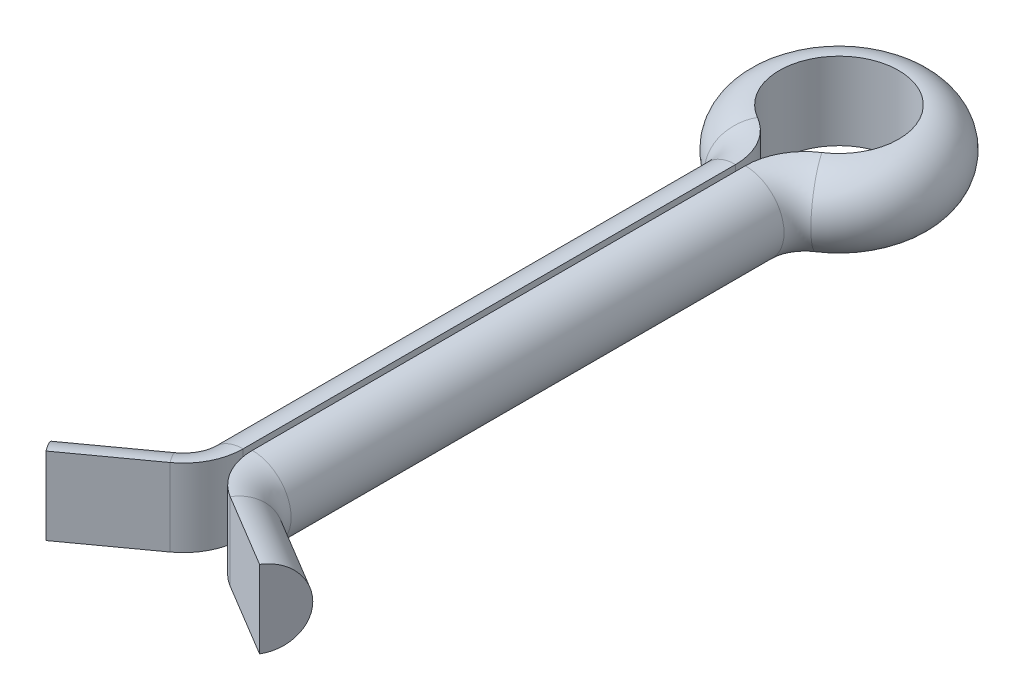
ISO-10303-21;
HEADER;
FILE_DESCRIPTION(('STEP AP214'),'2;1');
FILE_NAME('part.step','',(''),(''),'','','');
FILE_SCHEMA(('AUTOMOTIVE_DESIGN { 1 0 10303 214 1 1 1 1 }'));
ENDSEC;
DATA;
#1=APPLICATION_CONTEXT('core data for automotive mechanical design processes');
#2=APPLICATION_PROTOCOL_DEFINITION('international standard','automotive_design',2000,#1);
#3=PRODUCT_CONTEXT('',#1,'mechanical');
#4=PRODUCT('Part','Part','',(#3));
#5=PRODUCT_RELATED_PRODUCT_CATEGORY('part','',(#4));
#6=PRODUCT_DEFINITION_FORMATION('','',#4);
#7=PRODUCT_DEFINITION_CONTEXT('part definition',#1,'design');
#8=PRODUCT_DEFINITION('design','',#6,#7);
#9=PRODUCT_DEFINITION_SHAPE('','',#8);
#10=(LENGTH_UNIT() NAMED_UNIT(*) SI_UNIT(.MILLI.,.METRE.));
#11=(NAMED_UNIT(*) PLANE_ANGLE_UNIT() SI_UNIT($,.RADIAN.));
#12=(NAMED_UNIT(*) SI_UNIT($,.STERADIAN.) SOLID_ANGLE_UNIT());
#13=UNCERTAINTY_MEASURE_WITH_UNIT(LENGTH_MEASURE(1.E-05),#10,'distance_accuracy_value','');
#14=(GEOMETRIC_REPRESENTATION_CONTEXT(3) GLOBAL_UNCERTAINTY_ASSIGNED_CONTEXT((#13)) GLOBAL_UNIT_ASSIGNED_CONTEXT((#10,
#11,#12)) REPRESENTATION_CONTEXT('',''));
#15=CARTESIAN_POINT('',(0.,0.,0.));
#16=DIRECTION('',(0.,0.,1.));
#17=DIRECTION('',(1.,0.,0.));
#18=AXIS2_PLACEMENT_3D('',#15,#16,#17);
#19=CARTESIAN_POINT('',(-0.827997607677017,1.29999999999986,0.598792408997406));
#20=DIRECTION('',(-0.586001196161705,0.,-0.810310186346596));
#21=DIRECTION('',(-0.810310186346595,0.,0.586001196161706));
#22=AXIS2_PLACEMENT_3D('',#19,#20,#21);
#23=PLANE('',#22);
#24=DIRECTION('',(0.,-1.,0.));
#25=VECTOR('',#24,1.);
#26=CARTESIAN_POINT('',(-0.827997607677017,1.29999999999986,0.598792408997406));
#27=LINE('',#26,#25);
#28=CARTESIAN_POINT('',(-0.827997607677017,1.29999999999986,0.598792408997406));
#29=VERTEX_POINT('',#28);
#30=CARTESIAN_POINT('',(-0.827997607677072,-1.3000000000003,0.598792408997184));
#31=VERTEX_POINT('',#30);
#32=EDGE_CURVE('E207',#29,#31,#27,.T.);
#33=ORIENTED_EDGE('',*,*,#32,.F.);
#34=DIRECTION('',(-0.810310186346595,0.,0.586001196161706));
#35=VECTOR('',#34,1.);
#36=CARTESIAN_POINT('',(-0.827997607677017,1.29999999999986,0.598792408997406));
#37=LINE('',#36,#35);
#38=CARTESIAN_POINT('',(-3.2412407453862,1.29999999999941,2.34400478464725));
#39=VERTEX_POINT('',#38);
#40=EDGE_CURVE('E39',#29,#39,#37,.T.);
#41=ORIENTED_EDGE('',*,*,#40,.T.);
#42=DIRECTION('',(0.,-1.,0.));
#43=VECTOR('',#42,1.);
#44=CARTESIAN_POINT('',(-3.2412407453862,1.29999999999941,2.34400478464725));
#45=LINE('',#44,#43);
#46=CARTESIAN_POINT('',(-3.24124074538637,-1.30000000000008,2.34400478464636));
#47=VERTEX_POINT('',#46);
#48=EDGE_CURVE('E46',#39,#47,#45,.T.);
#49=ORIENTED_EDGE('',*,*,#48,.T.);
#50=DIRECTION('',(-0.810310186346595,0.,0.586001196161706));
#51=VECTOR('',#50,1.);
#52=CARTESIAN_POINT('',(-0.827997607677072,-1.3000000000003,0.598792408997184));
#53=LINE('',#52,#51);
#54=EDGE_CURVE('E11',#31,#47,#53,.T.);
#55=ORIENTED_EDGE('',*,*,#54,.F.);
#56=EDGE_LOOP('',(#33,#41,#49,#55));
#57=FACE_BOUND('',#56,.T.);
#58=ADVANCED_FACE('F32',(#57),#23,.F.);
#59=CARTESIAN_POINT('',(-0.827997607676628,-4.44089209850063E-13,0.598792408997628));
#60=DIRECTION('',(-0.810310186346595,0.,0.586001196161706));
#61=DIRECTION('',(0.586001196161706,0.,0.810310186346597));
#62=AXIS2_PLACEMENT_3D('',#59,#60,#61);
#63=CYLINDRICAL_SURFACE('',#62,1.3);
#64=CARTESIAN_POINT('',(-0.827997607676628,-4.44089209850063E-13,0.598792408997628));
#65=DIRECTION('',(0.810310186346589,0.,-0.586001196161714));
#66=DIRECTION('',(-0.586001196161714,0.,-0.81031018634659));
#67=AXIS2_PLACEMENT_3D('',#64,#65,#66);
#68=CIRCLE('',#67,1.3);
#69=EDGE_CURVE('E204',#31,#29,#68,.T.);
#70=ORIENTED_EDGE('',*,*,#69,.F.);
#71=ORIENTED_EDGE('',*,*,#54,.T.);
#72=CARTESIAN_POINT('',(-3.24124074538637,0.,2.34400478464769));
#73=DIRECTION('',(0.810310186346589,0.,-0.586001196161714));
#74=DIRECTION('',(-0.586001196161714,0.,-0.81031018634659));
#75=AXIS2_PLACEMENT_3D('',#72,#73,#74);
#76=CIRCLE('',#75,1.3);
#77=EDGE_CURVE('E52',#47,#39,#76,.T.);
#78=ORIENTED_EDGE('',*,*,#77,.T.);
#79=ORIENTED_EDGE('',*,*,#40,.F.);
#80=EDGE_LOOP('',(#70,#71,#78,#79));
#81=FACE_BOUND('',#80,.T.);
#82=ADVANCED_FACE('F219',(#81),#63,.T.);
#83=CARTESIAN_POINT('',(-1.99999999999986,-2.22044604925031E-13,-1.02182796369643));
#84=DIRECTION('',(0.,-1.,0.));
#85=DIRECTION('',(0.,0.,-1.));
#86=AXIS2_PLACEMENT_3D('',#83,#84,#85);
#87=CYLINDRICAL_SURFACE('',#86,1.99999999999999);
#88=DIRECTION('',(0.,-1.,0.));
#89=VECTOR('',#88,1.);
#90=CARTESIAN_POINT('',(0.,1.29999999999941,-1.02182796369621));
#91=LINE('',#90,#89);
#92=CARTESIAN_POINT('',(0.,1.29999999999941,-1.02182796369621));
#93=VERTEX_POINT('',#92);
#94=CARTESIAN_POINT('',(-5.27355936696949E-13,-1.29999999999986,-1.02182796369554));
#95=VERTEX_POINT('',#94);
#96=EDGE_CURVE('E195',#93,#95,#91,.T.);
#97=ORIENTED_EDGE('',*,*,#96,.F.);
#98=CARTESIAN_POINT('',(-2.00000000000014,1.30000000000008,-1.02182796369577));
#99=DIRECTION('',(0.,-1.,0.));
#100=DIRECTION('',(0.,0.,-1.));
#101=AXIS2_PLACEMENT_3D('',#98,#99,#100);
#102=CIRCLE('',#101,1.99999999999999);
#103=EDGE_CURVE('E210',#93,#29,#102,.T.);
#104=ORIENTED_EDGE('',*,*,#103,.T.);
#105=ORIENTED_EDGE('',*,*,#32,.T.);
#106=CARTESIAN_POINT('',(-1.99999999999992,-1.3000000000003,-1.02182796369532));
#107=DIRECTION('',(0.,-1.,0.));
#108=DIRECTION('',(0.,0.,-1.));
#109=AXIS2_PLACEMENT_3D('',#106,#107,#108);
#110=CIRCLE('',#109,1.99999999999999);
#111=EDGE_CURVE('E213',#95,#31,#110,.T.);
#112=ORIENTED_EDGE('',*,*,#111,.F.);
#113=EDGE_LOOP('',(#97,#104,#105,#112));
#114=FACE_BOUND('',#113,.T.);
#115=ADVANCED_FACE('F223',(#114),#87,.T.);
#116=CARTESIAN_POINT('',(-1.99999999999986,-2.22044604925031E-13,-1.02182796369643));
#117=DIRECTION('',(0.,-1.,0.));
#118=DIRECTION('',(0.,0.,-1.));
#119=AXIS2_PLACEMENT_3D('',#116,#117,#118);
#120=TOROIDAL_SURFACE('',#119,1.99999999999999,1.3);
#121=CARTESIAN_POINT('',(0.,-4.44089209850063E-13,-1.02182796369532));
#122=DIRECTION('',(0.,0.,-1.));
#123=DIRECTION('',(-1.,0.,0.));
#124=AXIS2_PLACEMENT_3D('',#121,#122,#123);
#125=CIRCLE('',#124,1.3);
#126=EDGE_CURVE('E192',#95,#93,#125,.T.);
#127=ORIENTED_EDGE('',*,*,#126,.F.);
#128=ORIENTED_EDGE('',*,*,#111,.T.);
#129=ORIENTED_EDGE('',*,*,#69,.T.);
#130=ORIENTED_EDGE('',*,*,#103,.F.);
#131=EDGE_LOOP('',(#127,#128,#129,#130));
#132=FACE_BOUND('',#131,.T.);
#133=ADVANCED_FACE('F225',(#132),#120,.T.);
#134=CARTESIAN_POINT('',(0.,1.29999999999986,-17.5358983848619));
#135=DIRECTION('',(-1.,0.,0.));
#136=DIRECTION('',(0.,0.,1.));
#137=AXIS2_PLACEMENT_3D('',#134,#135,#136);
#138=PLANE('',#137);
#139=DIRECTION('',(0.,-1.,0.));
#140=VECTOR('',#139,1.);
#141=CARTESIAN_POINT('',(0.,1.29999999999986,-17.5358983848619));
#142=LINE('',#141,#140);
#143=CARTESIAN_POINT('',(0.,1.29999999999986,-17.5358983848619));
#144=VERTEX_POINT('',#143);
#145=CARTESIAN_POINT('',(-1.38777878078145E-13,-1.3000000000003,-17.5358983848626));
#146=VERTEX_POINT('',#145);
#147=EDGE_CURVE('E183',#144,#146,#142,.T.);
#148=ORIENTED_EDGE('',*,*,#147,.F.);
#149=DIRECTION('',(0.,0.,1.));
#150=VECTOR('',#149,1.);
#151=CARTESIAN_POINT('',(0.,1.29999999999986,-17.5358983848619));
#152=LINE('',#151,#150);
#153=EDGE_CURVE('E198',#144,#93,#152,.T.);
#154=ORIENTED_EDGE('',*,*,#153,.T.);
#155=ORIENTED_EDGE('',*,*,#96,.T.);
#156=DIRECTION('',(0.,0.,1.));
#157=VECTOR('',#156,1.);
#158=CARTESIAN_POINT('',(-1.38777878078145E-13,-1.3000000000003,-17.5358983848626));
#159=LINE('',#158,#157);
#160=EDGE_CURVE('E201',#146,#95,#159,.T.);
#161=ORIENTED_EDGE('',*,*,#160,.F.);
#162=EDGE_LOOP('',(#148,#154,#155,#161));
#163=FACE_BOUND('',#162,.T.);
#164=ADVANCED_FACE('F229',(#163),#138,.F.);
#165=CARTESIAN_POINT('',(0.,-2.22044604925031E-13,-17.5358983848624));
#166=DIRECTION('',(0.,0.,1.));
#167=DIRECTION('',(1.,0.,0.));
#168=AXIS2_PLACEMENT_3D('',#165,#166,#167);
#169=CYLINDRICAL_SURFACE('',#168,1.3);
#170=CARTESIAN_POINT('',(0.,-2.22044604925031E-13,-17.5358983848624));
#171=DIRECTION('',(0.,0.,-1.));
#172=DIRECTION('',(-1.,0.,0.));
#173=AXIS2_PLACEMENT_3D('',#170,#171,#172);
#174=CIRCLE('',#173,1.3);
#175=EDGE_CURVE('E180',#146,#144,#174,.T.);
#176=ORIENTED_EDGE('',*,*,#175,.F.);
#177=ORIENTED_EDGE('',*,*,#160,.T.);
#178=ORIENTED_EDGE('',*,*,#126,.T.);
#179=ORIENTED_EDGE('',*,*,#153,.F.);
#180=EDGE_LOOP('',(#176,#177,#178,#179));
#181=FACE_BOUND('',#180,.T.);
#182=ADVANCED_FACE('F231',(#181),#169,.T.);
#183=CARTESIAN_POINT('',(-1.99999999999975,4.44089209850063E-13,-17.5358983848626));
#184=DIRECTION('',(0.,-1.,0.));
#185=DIRECTION('',(0.,0.,-1.));
#186=AXIS2_PLACEMENT_3D('',#183,#184,#185);
#187=CYLINDRICAL_SURFACE('',#186,1.99999999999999);
#188=DIRECTION('',(0.,-1.,0.));
#189=VECTOR('',#188,1.);
#190=CARTESIAN_POINT('',(-0.999999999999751,1.29999999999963,-19.2679491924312));
#191=LINE('',#190,#189);
#192=CARTESIAN_POINT('',(-0.999999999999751,1.29999999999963,-19.2679491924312));
#193=VERTEX_POINT('',#192);
#194=CARTESIAN_POINT('',(-1.00000000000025,-1.29999999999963,-19.2679491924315));
#195=VERTEX_POINT('',#194);
#196=EDGE_CURVE('E171',#193,#195,#191,.T.);
#197=ORIENTED_EDGE('',*,*,#196,.F.);
#198=CARTESIAN_POINT('',(-1.99999999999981,1.29999999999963,-17.5358983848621));
#199=DIRECTION('',(0.,-1.,0.));
#200=DIRECTION('',(0.,0.,-1.));
#201=AXIS2_PLACEMENT_3D('',#198,#199,#200);
#202=CIRCLE('',#201,1.99999999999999);
#203=EDGE_CURVE('E186',#193,#144,#202,.T.);
#204=ORIENTED_EDGE('',*,*,#203,.T.);
#205=ORIENTED_EDGE('',*,*,#147,.T.);
#206=CARTESIAN_POINT('',(-1.99999999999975,-1.29999999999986,-17.5358983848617));
#207=DIRECTION('',(0.,-1.,0.));
#208=DIRECTION('',(0.,0.,-1.));
#209=AXIS2_PLACEMENT_3D('',#206,#207,#208);
#210=CIRCLE('',#209,1.99999999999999);
#211=EDGE_CURVE('E189',#195,#146,#210,.T.);
#212=ORIENTED_EDGE('',*,*,#211,.F.);
#213=EDGE_LOOP('',(#197,#204,#205,#212));
#214=FACE_BOUND('',#213,.T.);
#215=ADVANCED_FACE('F235',(#214),#187,.T.);
#216=CARTESIAN_POINT('',(-1.99999999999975,4.44089209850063E-13,-17.5358983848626));
#217=DIRECTION('',(0.,-1.,0.));
#218=DIRECTION('',(0.,0.,-1.));
#219=AXIS2_PLACEMENT_3D('',#216,#217,#218);
#220=TOROIDAL_SURFACE('',#219,1.99999999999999,1.3);
#221=CARTESIAN_POINT('',(-0.999999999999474,-2.22044604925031E-13,-19.2679491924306));
#222=DIRECTION('',(-0.866025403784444,0.,-0.499999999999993));
#223=DIRECTION('',(-0.499999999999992,0.,0.866025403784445));
#224=AXIS2_PLACEMENT_3D('',#221,#222,#223);
#225=CIRCLE('',#224,1.3);
#226=EDGE_CURVE('E168',#195,#193,#225,.T.);
#227=ORIENTED_EDGE('',*,*,#226,.F.);
#228=ORIENTED_EDGE('',*,*,#211,.T.);
#229=ORIENTED_EDGE('',*,*,#175,.T.);
#230=ORIENTED_EDGE('',*,*,#203,.F.);
#231=EDGE_LOOP('',(#227,#228,#229,#230));
#232=FACE_BOUND('',#231,.T.);
#233=ADVANCED_FACE('F237',(#232),#220,.T.);
#234=CARTESIAN_POINT('',(-1.94289029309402E-13,0.,-20.9999999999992));
#235=DIRECTION('',(0.,1.,0.));
#236=DIRECTION('',(0.,0.,1.));
#237=AXIS2_PLACEMENT_3D('',#234,#235,#236);
#238=CYLINDRICAL_SURFACE('',#237,2.00000000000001);
#239=DIRECTION('',(0.,-1.,0.));
#240=VECTOR('',#239,1.);
#241=CARTESIAN_POINT('',(1.10000000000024,1.29999999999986,-19.3296706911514));
#242=LINE('',#241,#240);
#243=CARTESIAN_POINT('',(1.10000000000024,1.29999999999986,-19.3296706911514));
#244=VERTEX_POINT('',#243);
#245=CARTESIAN_POINT('',(1.0999999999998,-1.29999999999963,-19.329670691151));
#246=VERTEX_POINT('',#245);
#247=EDGE_CURVE('E159',#244,#246,#242,.T.);
#248=ORIENTED_EDGE('',*,*,#247,.F.);
#249=CARTESIAN_POINT('',(-5.82867087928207E-13,1.29999999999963,-21.0000000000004));
#250=DIRECTION('',(0.,1.,0.));
#251=DIRECTION('',(0.,0.,1.));
#252=AXIS2_PLACEMENT_3D('',#249,#250,#251);
#253=CIRCLE('',#252,2.00000000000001);
#254=EDGE_CURVE('E174',#244,#193,#253,.T.);
#255=ORIENTED_EDGE('',*,*,#254,.T.);
#256=ORIENTED_EDGE('',*,*,#196,.T.);
#257=CARTESIAN_POINT('',(-4.16333634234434E-13,-1.3000000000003,-20.9999999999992));
#258=DIRECTION('',(0.,1.,0.));
#259=DIRECTION('',(0.,0.,1.));
#260=AXIS2_PLACEMENT_3D('',#257,#258,#259);
#261=CIRCLE('',#260,2.00000000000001);
#262=EDGE_CURVE('E177',#246,#195,#261,.T.);
#263=ORIENTED_EDGE('',*,*,#262,.F.);
#264=EDGE_LOOP('',(#248,#255,#256,#263));
#265=FACE_BOUND('',#264,.T.);
#266=ADVANCED_FACE('F241',(#265),#238,.F.);
#267=CARTESIAN_POINT('',(-1.94289029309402E-13,0.,-20.9999999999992));
#268=DIRECTION('',(0.,1.,0.));
#269=DIRECTION('',(0.,0.,1.));
#270=AXIS2_PLACEMENT_3D('',#267,#268,#269);
#271=TOROIDAL_SURFACE('',#270,2.00000000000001,1.3);
#272=CARTESIAN_POINT('',(1.09999999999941,-2.22044604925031E-13,-19.3296706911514));
#273=DIRECTION('',(-0.835164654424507,0.,0.549999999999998));
#274=DIRECTION('',(0.549999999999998,0.,0.835164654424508));
#275=AXIS2_PLACEMENT_3D('',#272,#273,#274);
#276=CIRCLE('',#275,1.3);
#277=EDGE_CURVE('E156',#246,#244,#276,.T.);
#278=ORIENTED_EDGE('',*,*,#277,.F.);
#279=ORIENTED_EDGE('',*,*,#262,.T.);
#280=ORIENTED_EDGE('',*,*,#226,.T.);
#281=ORIENTED_EDGE('',*,*,#254,.F.);
#282=EDGE_LOOP('',(#278,#279,#280,#281));
#283=FACE_BOUND('',#282,.T.);
#284=ADVANCED_FACE('F243',(#283),#271,.T.);
#285=CARTESIAN_POINT('',(2.20000000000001,-4.44089209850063E-13,-17.6593413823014));
#286=DIRECTION('',(0.,-1.,0.));
#287=DIRECTION('',(0.,0.,-1.));
#288=AXIS2_PLACEMENT_3D('',#285,#286,#287);
#289=CYLINDRICAL_SURFACE('',#288,2.);
#290=DIRECTION('',(0.,-1.,0.));
#291=VECTOR('',#290,1.);
#292=CARTESIAN_POINT('',(0.200000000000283,1.29999999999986,-17.6593413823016));
#293=LINE('',#292,#291);
#294=CARTESIAN_POINT('',(0.200000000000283,1.29999999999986,-17.6593413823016));
#295=VERTEX_POINT('',#294);
#296=CARTESIAN_POINT('',(0.199999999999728,-1.30000000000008,-17.6593413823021));
#297=VERTEX_POINT('',#296);
#298=EDGE_CURVE('E147',#295,#297,#293,.T.);
#299=ORIENTED_EDGE('',*,*,#298,.F.);
#300=CARTESIAN_POINT('',(2.20000000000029,1.30000000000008,-17.6593413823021));
#301=DIRECTION('',(0.,-1.,0.));
#302=DIRECTION('',(0.,0.,-1.));
#303=AXIS2_PLACEMENT_3D('',#300,#301,#302);
#304=CIRCLE('',#303,2.);
#305=EDGE_CURVE('E162',#295,#244,#304,.T.);
#306=ORIENTED_EDGE('',*,*,#305,.T.);
#307=ORIENTED_EDGE('',*,*,#247,.T.);
#308=CARTESIAN_POINT('',(2.19999999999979,-1.30000000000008,-17.6593413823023));
#309=DIRECTION('',(0.,-1.,0.));
#310=DIRECTION('',(0.,0.,-1.));
#311=AXIS2_PLACEMENT_3D('',#308,#309,#310);
#312=CIRCLE('',#311,2.);
#313=EDGE_CURVE('E165',#297,#246,#312,.T.);
#314=ORIENTED_EDGE('',*,*,#313,.F.);
#315=EDGE_LOOP('',(#299,#306,#307,#314));
#316=FACE_BOUND('',#315,.T.);
#317=ADVANCED_FACE('F247',(#316),#289,.T.);
#318=CARTESIAN_POINT('',(2.20000000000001,-4.44089209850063E-13,-17.6593413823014));
#319=DIRECTION('',(0.,-1.,0.));
#320=DIRECTION('',(0.,0.,-1.));
#321=AXIS2_PLACEMENT_3D('',#318,#319,#320);
#322=TOROIDAL_SURFACE('',#321,2.,1.3);
#323=CARTESIAN_POINT('',(0.199999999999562,-4.44089209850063E-13,-17.6593413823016));
#324=DIRECTION('',(0.,0.,1.));
#325=DIRECTION('',(1.,0.,0.));
#326=AXIS2_PLACEMENT_3D('',#323,#324,#325);
#327=CIRCLE('',#326,1.3);
#328=EDGE_CURVE('E144',#297,#295,#327,.T.);
#329=ORIENTED_EDGE('',*,*,#328,.F.);
#330=ORIENTED_EDGE('',*,*,#313,.T.);
#331=ORIENTED_EDGE('',*,*,#277,.T.);
#332=ORIENTED_EDGE('',*,*,#305,.F.);
#333=EDGE_LOOP('',(#329,#330,#331,#332));
#334=FACE_BOUND('',#333,.T.);
#335=ADVANCED_FACE('F249',(#334),#322,.T.);
#336=CARTESIAN_POINT('',(0.199999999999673,1.29999999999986,-1.13324821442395));
#337=DIRECTION('',(1.,0.,0.));
#338=DIRECTION('',(0.,0.,-1.));
#339=AXIS2_PLACEMENT_3D('',#336,#337,#338);
#340=PLANE('',#339);
#341=DIRECTION('',(0.,-1.,0.));
#342=VECTOR('',#341,1.);
#343=CARTESIAN_POINT('',(0.199999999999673,1.29999999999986,-1.13324821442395));
#344=LINE('',#343,#342);
#345=CARTESIAN_POINT('',(0.199999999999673,1.29999999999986,-1.13324821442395));
#346=VERTEX_POINT('',#345);
#347=CARTESIAN_POINT('',(0.199999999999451,-1.29999999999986,-1.13324821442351));
#348=VERTEX_POINT('',#347);
#349=EDGE_CURVE('E135',#346,#348,#344,.T.);
#350=ORIENTED_EDGE('',*,*,#349,.F.);
#351=DIRECTION('',(0.,0.,-1.));
#352=VECTOR('',#351,1.);
#353=CARTESIAN_POINT('',(0.199999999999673,1.29999999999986,-1.13324821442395));
#354=LINE('',#353,#352);
#355=EDGE_CURVE('E150',#346,#295,#354,.T.);
#356=ORIENTED_EDGE('',*,*,#355,.T.);
#357=ORIENTED_EDGE('',*,*,#298,.T.);
#358=DIRECTION('',(0.,0.,-1.));
#359=VECTOR('',#358,1.);
#360=CARTESIAN_POINT('',(0.199999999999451,-1.29999999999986,-1.13324821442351));
#361=LINE('',#360,#359);
#362=EDGE_CURVE('E153',#348,#297,#361,.T.);
#363=ORIENTED_EDGE('',*,*,#362,.F.);
#364=EDGE_LOOP('',(#350,#356,#357,#363));
#365=FACE_BOUND('',#364,.T.);
#366=ADVANCED_FACE('F253',(#365),#340,.F.);
#367=CARTESIAN_POINT('',(0.200000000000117,-2.22044604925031E-13,-1.13324821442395));
#368=DIRECTION('',(0.,0.,-1.));
#369=DIRECTION('',(-1.,0.,0.));
#370=AXIS2_PLACEMENT_3D('',#367,#368,#369);
#371=CYLINDRICAL_SURFACE('',#370,1.3);
#372=CARTESIAN_POINT('',(0.200000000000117,-2.22044604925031E-13,-1.13324821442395));
#373=DIRECTION('',(0.,0.,1.));
#374=DIRECTION('',(1.,0.,0.));
#375=AXIS2_PLACEMENT_3D('',#372,#373,#374);
#376=CIRCLE('',#375,1.3);
#377=EDGE_CURVE('E131',#348,#346,#376,.T.);
#378=ORIENTED_EDGE('',*,*,#377,.F.);
#379=ORIENTED_EDGE('',*,*,#362,.T.);
#380=ORIENTED_EDGE('',*,*,#328,.T.);
#381=ORIENTED_EDGE('',*,*,#355,.F.);
#382=EDGE_LOOP('',(#378,#379,#380,#381));
#383=FACE_BOUND('',#382,.T.);
#384=ADVANCED_FACE('F255',(#383),#371,.T.);
#385=CARTESIAN_POINT('',(2.20000000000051,-2.22044604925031E-13,-1.13324821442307));
#386=DIRECTION('',(0.,-1.,0.));
#387=DIRECTION('',(0.,0.,-1.));
#388=AXIS2_PLACEMENT_3D('',#385,#386,#387);
#389=CYLINDRICAL_SURFACE('',#388,2.);
#390=DIRECTION('',(0.,-1.,0.));
#391=VECTOR('',#390,1.);
#392=CARTESIAN_POINT('',(1.17213504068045,1.29999999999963,0.582413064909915));
#393=LINE('',#392,#391);
#394=CARTESIAN_POINT('',(1.17213504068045,1.29999999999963,0.582413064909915));
#395=VERTEX_POINT('',#394);
#396=CARTESIAN_POINT('',(1.17213504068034,-1.29999999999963,0.582413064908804));
#397=VERTEX_POINT('',#396);
#398=EDGE_CURVE('E120',#395,#397,#393,.T.);
#399=ORIENTED_EDGE('',*,*,#398,.F.);
#400=CARTESIAN_POINT('',(2.19999999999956,1.3000000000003,-1.13324821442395));
#401=DIRECTION('',(0.,-1.,0.));
#402=DIRECTION('',(0.,0.,-1.));
#403=AXIS2_PLACEMENT_3D('',#400,#401,#402);
#404=CIRCLE('',#403,2.);
#405=EDGE_CURVE('E138',#395,#346,#404,.T.);
#406=ORIENTED_EDGE('',*,*,#405,.T.);
#407=ORIENTED_EDGE('',*,*,#349,.T.);
#408=CARTESIAN_POINT('',(2.19999999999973,-1.30000000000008,-1.1332482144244));
#409=DIRECTION('',(0.,-1.,0.));
#410=DIRECTION('',(0.,0.,-1.));
#411=AXIS2_PLACEMENT_3D('',#408,#409,#410);
#412=CIRCLE('',#411,2.);
#413=EDGE_CURVE('E141',#397,#348,#412,.T.);
#414=ORIENTED_EDGE('',*,*,#413,.F.);
#415=EDGE_LOOP('',(#399,#406,#407,#414));
#416=FACE_BOUND('',#415,.T.);
#417=ADVANCED_FACE('F259',(#416),#389,.T.);
#418=CARTESIAN_POINT('',(2.20000000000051,-2.22044604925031E-13,-1.13324821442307));
#419=DIRECTION('',(0.,-1.,0.));
#420=DIRECTION('',(0.,0.,-1.));
#421=AXIS2_PLACEMENT_3D('',#418,#419,#420);
#422=TOROIDAL_SURFACE('',#421,2.,1.3);
#423=CARTESIAN_POINT('',(1.17213504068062,-2.22044604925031E-13,0.58241306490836));
#424=DIRECTION('',(0.857830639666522,0.,0.513932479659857));
#425=DIRECTION('',(0.513932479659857,0.,-0.857830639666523));
#426=AXIS2_PLACEMENT_3D('',#423,#424,#425);
#427=CIRCLE('',#426,1.3);
#428=EDGE_CURVE('E115',#397,#395,#427,.T.);
#429=ORIENTED_EDGE('',*,*,#428,.F.);
#430=ORIENTED_EDGE('',*,*,#413,.T.);
#431=ORIENTED_EDGE('',*,*,#377,.T.);
#432=ORIENTED_EDGE('',*,*,#405,.F.);
#433=EDGE_LOOP('',(#429,#430,#431,#432));
#434=FACE_BOUND('',#433,.T.);
#435=ADVANCED_FACE('F260',(#434),#422,.T.);
#436=CARTESIAN_POINT('',(1.17213504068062,-2.22044604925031E-13,0.58241306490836));
#437=DIRECTION('',(0.857830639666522,0.,0.513932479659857));
#438=DIRECTION('',(0.513932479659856,0.,-0.857830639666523));
#439=AXIS2_PLACEMENT_3D('',#436,#437,#438);
#440=CYLINDRICAL_SURFACE('',#439,1.3);
#441=CARTESIAN_POINT('',(3.63132255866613,-2.22044604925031E-13,2.05572991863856));
#442=DIRECTION('',(0.857830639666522,0.,0.513932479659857));
#443=DIRECTION('',(0.513932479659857,0.,-0.857830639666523));
#444=AXIS2_PLACEMENT_3D('',#441,#442,#443);
#445=CIRCLE('',#444,1.3);
#446=CARTESIAN_POINT('',(3.63132255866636,-1.30000000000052,2.05572991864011));
#447=VERTEX_POINT('',#446);
#448=CARTESIAN_POINT('',(3.63132255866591,1.29999999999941,2.05572991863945));
#449=VERTEX_POINT('',#448);
#450=EDGE_CURVE('E112',#447,#449,#445,.T.);
#451=ORIENTED_EDGE('',*,*,#450,.F.);
#452=DIRECTION('',(0.857830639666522,0.,0.513932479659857));
#453=VECTOR('',#452,1.);
#454=CARTESIAN_POINT('',(1.17213504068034,-1.29999999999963,0.582413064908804));
#455=LINE('',#454,#453);
#456=EDGE_CURVE('E119',#397,#447,#455,.T.);
#457=ORIENTED_EDGE('',*,*,#456,.F.);
#458=ORIENTED_EDGE('',*,*,#428,.T.);
#459=DIRECTION('',(0.857830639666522,0.,0.513932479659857));
#460=VECTOR('',#459,1.);
#461=CARTESIAN_POINT('',(1.17213504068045,1.29999999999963,0.582413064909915));
#462=LINE('',#461,#460);
#463=EDGE_CURVE('E108',#395,#449,#462,.T.);
#464=ORIENTED_EDGE('',*,*,#463,.T.);
#465=EDGE_LOOP('',(#451,#457,#458,#464));
#466=FACE_BOUND('',#465,.T.);
#467=ADVANCED_FACE('F110',(#466),#440,.T.);
#468=CARTESIAN_POINT('',(1.17213504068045,1.29999999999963,0.582413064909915));
#469=DIRECTION('',(-0.513932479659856,0.,0.857830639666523));
#470=DIRECTION('',(0.857830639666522,0.,0.513932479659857));
#471=AXIS2_PLACEMENT_3D('',#468,#469,#470);
#472=PLANE('',#471);
#473=DIRECTION('',(0.,-1.,0.));
#474=VECTOR('',#473,1.);
#475=CARTESIAN_POINT('',(3.63132255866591,1.29999999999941,2.05572991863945));
#476=LINE('',#475,#474);
#477=EDGE_CURVE('E124',#449,#447,#476,.T.);
#478=ORIENTED_EDGE('',*,*,#477,.F.);
#479=ORIENTED_EDGE('',*,*,#463,.F.);
#480=ORIENTED_EDGE('',*,*,#398,.T.);
#481=ORIENTED_EDGE('',*,*,#456,.T.);
#482=EDGE_LOOP('',(#478,#479,#480,#481));
#483=FACE_BOUND('',#482,.T.);
#484=ADVANCED_FACE('F126',(#483),#472,.T.);
#485=CARTESIAN_POINT('',(-3.24124074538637,0.,2.34400478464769));
#486=DIRECTION('',(0.810310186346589,0.,-0.586001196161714));
#487=DIRECTION('',(-0.586001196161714,0.,-0.81031018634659));
#488=AXIS2_PLACEMENT_3D('',#485,#486,#487);
#489=PLANE('',#488);
#490=ORIENTED_EDGE('',*,*,#77,.F.);
#491=ORIENTED_EDGE('',*,*,#48,.F.);
#492=EDGE_LOOP('',(#490,#491));
#493=FACE_BOUND('',#492,.T.);
#494=ADVANCED_FACE('F325',(#493),#489,.F.);
#495=CARTESIAN_POINT('',(3.63132255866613,-2.22044604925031E-13,2.05572991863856));
#496=DIRECTION('',(0.857830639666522,0.,0.513932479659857));
#497=DIRECTION('',(0.513932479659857,0.,-0.857830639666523));
#498=AXIS2_PLACEMENT_3D('',#495,#496,#497);
#499=PLANE('',#498);
#500=ORIENTED_EDGE('',*,*,#450,.T.);
#501=ORIENTED_EDGE('',*,*,#477,.T.);
#502=EDGE_LOOP('',(#500,#501));
#503=FACE_BOUND('',#502,.T.);
#504=ADVANCED_FACE('F123',(#503),#499,.T.);
#505=CLOSED_SHELL('',(#58,#82,#115,#133,#164,#182,#215,#233,#266,#284,#317,#335,#366,#384,#417,
#435,#467,#484,#494,#504));
#506=MANIFOLD_SOLID_BREP('B2',#505);
#507=ADVANCED_BREP_SHAPE_REPRESENTATION('',(#18,#506),#14);
#508=SHAPE_DEFINITION_REPRESENTATION(#9,#507);
ENDSEC;
END-ISO-10303-21;
